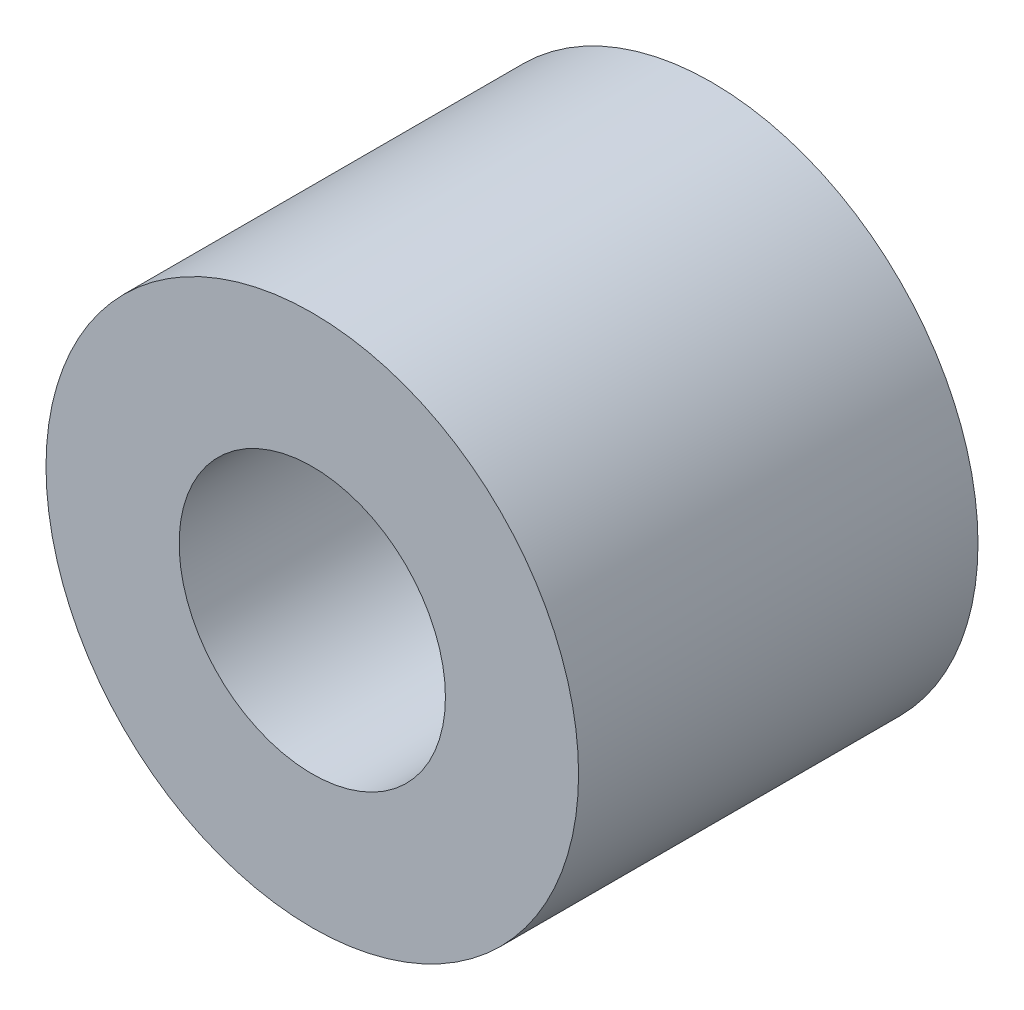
ISO-10303-21;
HEADER;
FILE_DESCRIPTION(('STEP AP214'),'2;1');
FILE_NAME('part.step','',(''),(''),'','','');
FILE_SCHEMA(('AUTOMOTIVE_DESIGN { 1 0 10303 214 1 1 1 1 }'));
ENDSEC;
DATA;
#1=APPLICATION_CONTEXT('core data for automotive mechanical design processes');
#2=APPLICATION_PROTOCOL_DEFINITION('international standard','automotive_design',2000,#1);
#3=PRODUCT_CONTEXT('',#1,'mechanical');
#4=PRODUCT('Part','Part','',(#3));
#5=PRODUCT_RELATED_PRODUCT_CATEGORY('part','',(#4));
#6=PRODUCT_DEFINITION_FORMATION('','',#4);
#7=PRODUCT_DEFINITION_CONTEXT('part definition',#1,'design');
#8=PRODUCT_DEFINITION('design','',#6,#7);
#9=PRODUCT_DEFINITION_SHAPE('','',#8);
#10=(LENGTH_UNIT() NAMED_UNIT(*) SI_UNIT(.MILLI.,.METRE.));
#11=(NAMED_UNIT(*) PLANE_ANGLE_UNIT() SI_UNIT($,.RADIAN.));
#12=(NAMED_UNIT(*) SI_UNIT($,.STERADIAN.) SOLID_ANGLE_UNIT());
#13=UNCERTAINTY_MEASURE_WITH_UNIT(LENGTH_MEASURE(1.E-05),#10,'distance_accuracy_value','');
#14=(GEOMETRIC_REPRESENTATION_CONTEXT(3) GLOBAL_UNCERTAINTY_ASSIGNED_CONTEXT((#13)) GLOBAL_UNIT_ASSIGNED_CONTEXT((#10,
#11,#12)) REPRESENTATION_CONTEXT('',''));
#15=CARTESIAN_POINT('',(0.,0.,0.));
#16=DIRECTION('',(0.,0.,1.));
#17=DIRECTION('',(1.,0.,0.));
#18=AXIS2_PLACEMENT_3D('',#15,#16,#17);
#19=CARTESIAN_POINT('',(0.,0.,0.));
#20=DIRECTION('',(0.,0.,1.));
#21=DIRECTION('',(1.,0.,0.));
#22=AXIS2_PLACEMENT_3D('',#19,#20,#21);
#23=PLANE('',#22);
#24=CARTESIAN_POINT('',(0.,0.,0.));
#25=DIRECTION('',(0.,0.,1.));
#26=DIRECTION('',(1.,0.,0.));
#27=AXIS2_PLACEMENT_3D('',#24,#25,#26);
#28=CIRCLE('',#27,10.);
#29=CARTESIAN_POINT('',(10.,0.,0.));
#30=VERTEX_POINT('',#29);
#31=EDGE_CURVE('E35',#30,#30,#28,.T.);
#32=ORIENTED_EDGE('',*,*,#31,.F.);
#33=EDGE_LOOP('',(#32));
#34=FACE_BOUND('',#33,.T.);
#35=CARTESIAN_POINT('',(0.,0.,0.));
#36=DIRECTION('',(0.,0.,1.));
#37=DIRECTION('',(1.,0.,0.));
#38=AXIS2_PLACEMENT_3D('',#35,#36,#37);
#39=CIRCLE('',#38,5.);
#40=CARTESIAN_POINT('',(5.,0.,0.));
#41=VERTEX_POINT('',#40);
#42=EDGE_CURVE('E43',#41,#41,#39,.T.);
#43=ORIENTED_EDGE('',*,*,#42,.T.);
#44=EDGE_LOOP('',(#43));
#45=FACE_BOUND('',#44,.T.);
#46=ADVANCED_FACE('F28',(#34,#45),#23,.F.);
#47=CARTESIAN_POINT('',(0.,0.,15.));
#48=DIRECTION('',(0.,0.,1.));
#49=DIRECTION('',(1.,0.,0.));
#50=AXIS2_PLACEMENT_3D('',#47,#48,#49);
#51=PLANE('',#50);
#52=CARTESIAN_POINT('',(0.,0.,15.));
#53=DIRECTION('',(0.,0.,1.));
#54=DIRECTION('',(1.,0.,0.));
#55=AXIS2_PLACEMENT_3D('',#52,#53,#54);
#56=CIRCLE('',#55,10.);
#57=CARTESIAN_POINT('',(10.,0.,15.));
#58=VERTEX_POINT('',#57);
#59=EDGE_CURVE('E10',#58,#58,#56,.T.);
#60=ORIENTED_EDGE('',*,*,#59,.T.);
#61=EDGE_LOOP('',(#60));
#62=FACE_BOUND('',#61,.T.);
#63=CARTESIAN_POINT('',(0.,0.,15.));
#64=DIRECTION('',(0.,0.,1.));
#65=DIRECTION('',(1.,0.,0.));
#66=AXIS2_PLACEMENT_3D('',#63,#64,#65);
#67=CIRCLE('',#66,5.);
#68=CARTESIAN_POINT('',(5.,0.,15.));
#69=VERTEX_POINT('',#68);
#70=EDGE_CURVE('E39',#69,#69,#67,.T.);
#71=ORIENTED_EDGE('',*,*,#70,.F.);
#72=EDGE_LOOP('',(#71));
#73=FACE_BOUND('',#72,.T.);
#74=ADVANCED_FACE('F57',(#62,#73),#51,.T.);
#75=CARTESIAN_POINT('',(0.,0.,15.));
#76=DIRECTION('',(0.,0.,-1.));
#77=DIRECTION('',(-1.,0.,0.));
#78=AXIS2_PLACEMENT_3D('',#75,#76,#77);
#79=CYLINDRICAL_SURFACE('',#78,10.);
#80=ORIENTED_EDGE('',*,*,#59,.F.);
#81=EDGE_LOOP('',(#80));
#82=FACE_BOUND('',#81,.T.);
#83=ORIENTED_EDGE('',*,*,#31,.T.);
#84=EDGE_LOOP('',(#83));
#85=FACE_BOUND('',#84,.T.);
#86=ADVANCED_FACE('F30',(#82,#85),#79,.T.);
#87=CARTESIAN_POINT('',(0.,0.,15.));
#88=DIRECTION('',(0.,0.,-1.));
#89=DIRECTION('',(-1.,0.,0.));
#90=AXIS2_PLACEMENT_3D('',#87,#88,#89);
#91=CYLINDRICAL_SURFACE('',#90,5.);
#92=ORIENTED_EDGE('',*,*,#70,.T.);
#93=EDGE_LOOP('',(#92));
#94=FACE_BOUND('',#93,.T.);
#95=ORIENTED_EDGE('',*,*,#42,.F.);
#96=EDGE_LOOP('',(#95));
#97=FACE_BOUND('',#96,.T.);
#98=ADVANCED_FACE('F50',(#94,#97),#91,.F.);
#99=CLOSED_SHELL('',(#46,#74,#86,#98));
#100=MANIFOLD_SOLID_BREP('B2',#99);
#101=ADVANCED_BREP_SHAPE_REPRESENTATION('',(#18,#100),#14);
#102=SHAPE_DEFINITION_REPRESENTATION(#9,#101);
ENDSEC;
END-ISO-10303-21;
